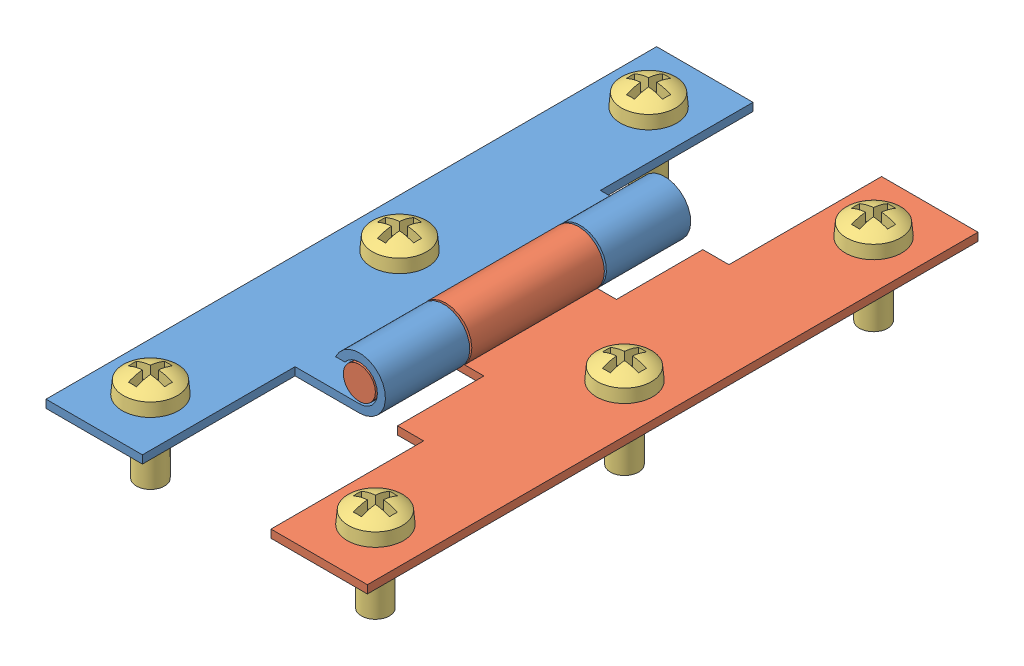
SolidWorks assembly TYOBAN-ASSY.SLDASM, configuration ﾃﾞﾌｫﾙﾄ (file format 10000). Lengths in mm.
Overall size (40 14.5 76).
8 component instances, 3 part files, 15 mates.
Components (placement in the parent):
- TYOBAN-A-1: TYOBAN-A.sldprt [Default] at origin size (23.25 6.5 76)
- TYOBAN-B-1: TYOBAN-B.sldprt [Default] x (-1 0 0) z (0 0 -1) size (23.25 6.5 76)
- ST3-5x9-1: ST3-5x9.sldprt [ﾃﾞﾌｫﾙﾄ] at (-14 -2.25 31) x (0 -1 0) z (0 0 1) size (11.65 7 7)
- ST3-5x9-2: ST3-5x9.sldprt [ﾃﾞﾌｫﾙﾄ] at (-14 -2.25 0) x (0 -1 0) z (0 0 1) size (11.65 7 7)
- ST3-5x9-3: ST3-5x9.sldprt [ﾃﾞﾌｫﾙﾄ] at (-14 -2.25 -31) x (0 -1 0) z (0 0 1) size (11.65 7 7)
- ST3-5x9-4: ST3-5x9.sldprt [ﾃﾞﾌｫﾙﾄ] at (14 -2.25 31) x (0 -1 0) z (0 0 1) size (11.65 7 7)
- ST3-5x9-5: ST3-5x9.sldprt [ﾃﾞﾌｫﾙﾄ] at (14 -2.25 0) x (0 -1 0) z (0 0 1) size (11.65 7 7)
- ST3-5x9-6: ST3-5x9.sldprt [ﾃﾞﾌｫﾙﾄ] at (14 -2.25 -31) x (0 -1 0) z (0 0 1) size (11.65 7 7)
Mates (geometry in assembly coordinates):
- 同心円1: concentric anti-aligned: cylinder of TYOBAN-A-1 through (0 0 38) axis (0 0 -1) radius 3.25; cylinder of TYOBAN-B-1 through (0 0 -38) axis (0 0 1) radius 3.25
- 一致1: coincident aligned: plane of TYOBAN-A-1 through (-20 -2.25 58.025) normal (0 1 0); plane of TYOBAN-B-1 through (20 -2.25 -58.025) normal (0 1 0)
- 一致2: coincident aligned: plane of TYOBAN-A-1 through (-8 3.25 19) normal (0 0 1); plane of TYOBAN-B-1 through (8 3.25 19) normal (0 0 1)
- 一致3: coincident anti-aligned: plane of TYOBAN-A-1 through (-20 -2.25 58.025) normal (0 1 0); plane of ST3-5x9-1 through (-10.5 -2.25 31) normal (0 -1 0)
- 同心円3: concentric aligned: cylinder of TYOBAN-A-1 through (-14 -2.25 31) axis (0 1 0) radius 2; cylinder of ST3-5x9-1 through (-14 -11.25 31) axis (0 1 0) radius 1.75
- 一致4: coincident anti-aligned: plane of TYOBAN-A-1 through (-20 -2.25 58.025) normal (0 1 0); plane of ST3-5x9-2 through (-10.5 -2.25 0) normal (0 -1 0)
- 同心円4: concentric aligned: cylinder of TYOBAN-A-1 through (-14 -2.25 0) axis (0 1 0) radius 2; cylinder of ST3-5x9-2 through (-14 -11.25 0) axis (0 1 0) radius 1.75
- 一致5: coincident anti-aligned: plane of TYOBAN-A-1 through (-20 -2.25 58.025) normal (0 1 0); plane of ST3-5x9-3 through (-10.5 -2.25 -31) normal (0 -1 0)
- 同心円5: concentric aligned: cylinder of TYOBAN-A-1 through (-14 -2.25 -31) axis (0 1 0) radius 2; cylinder of ST3-5x9-3 through (-14 -11.25 -31) axis (0 1 0) radius 1.75
- 一致6: coincident anti-aligned: plane of TYOBAN-B-1 through (20 -2.25 -58.025) normal (0 1 0); plane of ST3-5x9-4 through (17.5 -2.25 31) normal (0 -1 0)
- 同心円6: concentric aligned: cylinder of TYOBAN-B-1 through (14 -2.25 31) axis (0 1 0) radius 2; cylinder of ST3-5x9-4 through (14 -11.25 31) axis (0 1 0) radius 1.75
- 一致7: coincident anti-aligned: plane of TYOBAN-B-1 through (20 -2.25 -58.025) normal (0 1 0); plane of ST3-5x9-5 through (17.5 -2.25 0) normal (0 -1 0)
- 同心円7: concentric aligned: cylinder of TYOBAN-B-1 through (14 -2.25 0) axis (0 1 0) radius 2; cylinder of ST3-5x9-5 through (14 -11.25 0) axis (0 1 0) radius 1.75
- 一致8: coincident anti-aligned: plane of TYOBAN-B-1 through (20 -2.25 -58.025) normal (0 1 0); plane of ST3-5x9-6 through (17.5 -2.25 -31) normal (0 -1 0)
- 同心円8: concentric aligned: cylinder of TYOBAN-B-1 through (14 -2.25 -31) axis (0 1 0) radius 2; cylinder of ST3-5x9-6 through (14 -11.25 -31) axis (0 1 0) radius 1.75
